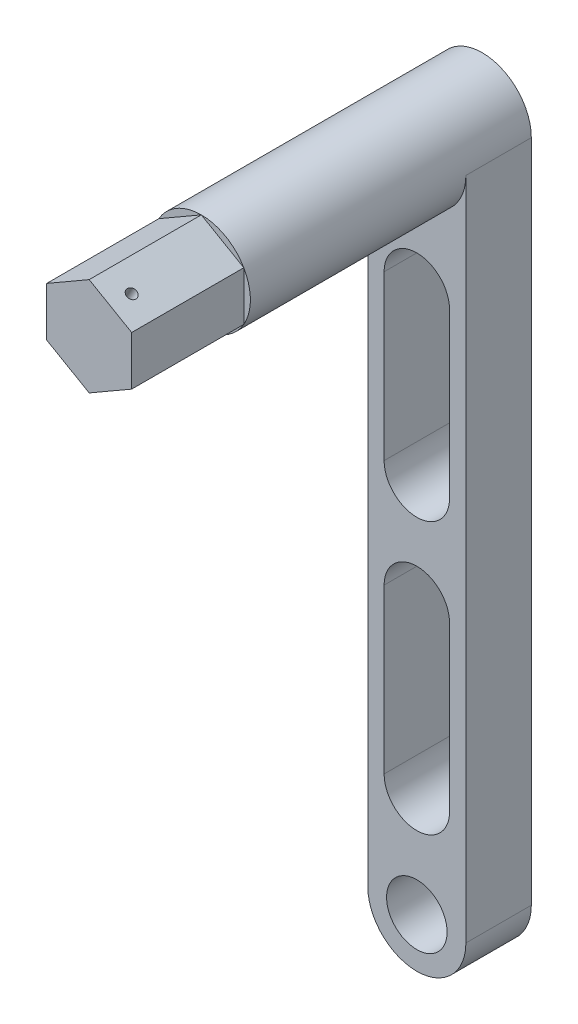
from build123d import *

# Parameters (mm, degrees)
SKETCH1_R               = 4.625
BOSS_EXTRUDE1_DEPTH     = 10
BOSS_EXTRUDE2_DEPTH     = 42.94
BOSS_EXTRUDE3_DEPTH     = 17.14
CUT_EXTRUDE1_DEPTH      = 123.845099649
CUT_EXTRUDE1_DEPTH_BACK = 123.845099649
SKETCH4_R               = 0.75


with BuildPart() as part:
    # Sketch1 → Boss-Extrude1 (new body)
    with BuildSketch(Plane.XY):
        with BuildLine():
            Line((-7.5, 50.8), (-7.5, -50.8))
            ThreePointArc((-7.5, -50.8), (0, -58.3), (7.5, -50.8))
            Line((7.5, -50.8), (7.5, 50.8))
            ThreePointArc((7.5, 50.8), (0, 43.3), (-7.5, 50.8))
        make_face()
        with Locations((0, -50.8)):
            Circle(SKETCH1_R, mode=Mode.SUBTRACT)
        with BuildLine():
            ThreePointArc((5, -34.675), (0, -39.675), (-5, -34.675))
            Line((-5, -34.675), (-5, -9.675))
            ThreePointArc((-5, -9.675), (0, -4.675), (5, -9.675))
            Line((5, -9.675), (5, -34.675))
        make_face(mode=Mode.SUBTRACT)
        with BuildLine():
            ThreePointArc((-5, 31.8), (0, 36.8), (5, 31.8))
            Line((5, 31.8), (5, 6.8))
            ThreePointArc((5, 6.8), (0, 1.8), (-5, 6.8))
            Line((-5, 6.8), (-5, 31.8))
        make_face(mode=Mode.SUBTRACT)
    extrude(amount=BOSS_EXTRUDE1_DEPTH)

    # Sketch1_4 → Boss-Extrude2 (add)
    with BuildSketch(Plane.XY):
        with BuildLine():
            ThreePointArc((7.5, 50.8), (0, 58.3), (-7.5, 50.8))
            ThreePointArc((-7.5, 50.8), (0, 43.3), (7.5, 50.8))
        make_face()
    extrude(amount=BOSS_EXTRUDE2_DEPTH)

    # Sketch3 → Boss-Extrude3 (add)
    with BuildSketch(Plane.XY.offset(42.94)):
        Polygon((0, 43.3), (6.495190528, 47.05), (6.495190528, 54.55), (0, 58.3), (-6.495190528, 54.55), (-6.495190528, 47.05), align=None)
    extrude(amount=BOSS_EXTRUDE3_DEPTH)

    # Sketch4 → Cut-Extrude1 (cut, two sides: drawn at the far end of the back side and taken through both)
    with BuildSketch(Plane(origin=(25.24464052, 43.725, 0), x_dir=(0.8660254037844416, -0.499999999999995, 0), z_dir=(0.49999999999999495, 0.8660254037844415, 0)).offset(-CUT_EXTRUDE1_DEPTH_BACK)):
        with Locations(Location((-25.4, -56.83, 0), (0, 0, 180))):
            Circle(SKETCH4_R)
    extrude(amount=CUT_EXTRUDE1_DEPTH + CUT_EXTRUDE1_DEPTH_BACK, mode=Mode.SUBTRACT)


solid = part.part
